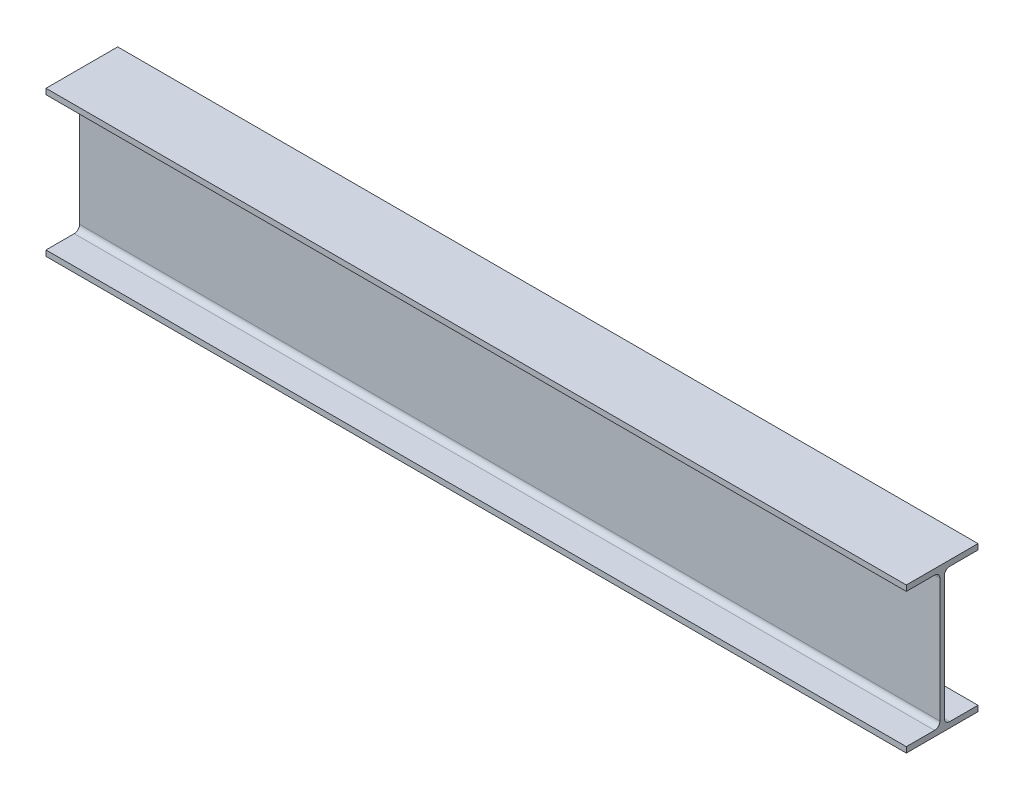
ISO-10303-21;
HEADER;
FILE_DESCRIPTION(('STEP AP214'),'2;1');
FILE_NAME('part.step','',(''),(''),'','','');
FILE_SCHEMA(('AUTOMOTIVE_DESIGN { 1 0 10303 214 1 1 1 1 }'));
ENDSEC;
DATA;
#1=APPLICATION_CONTEXT('core data for automotive mechanical design processes');
#2=APPLICATION_PROTOCOL_DEFINITION('international standard','automotive_design',2000,#1);
#3=PRODUCT_CONTEXT('',#1,'mechanical');
#4=PRODUCT('Part','Part','',(#3));
#5=PRODUCT_RELATED_PRODUCT_CATEGORY('part','',(#4));
#6=PRODUCT_DEFINITION_FORMATION('','',#4);
#7=PRODUCT_DEFINITION_CONTEXT('part definition',#1,'design');
#8=PRODUCT_DEFINITION('design','',#6,#7);
#9=PRODUCT_DEFINITION_SHAPE('','',#8);
#10=(LENGTH_UNIT() NAMED_UNIT(*) SI_UNIT(.MILLI.,.METRE.));
#11=(NAMED_UNIT(*) PLANE_ANGLE_UNIT() SI_UNIT($,.RADIAN.));
#12=(NAMED_UNIT(*) SI_UNIT($,.STERADIAN.) SOLID_ANGLE_UNIT());
#13=UNCERTAINTY_MEASURE_WITH_UNIT(LENGTH_MEASURE(1.E-05),#10,'distance_accuracy_value','');
#14=(GEOMETRIC_REPRESENTATION_CONTEXT(3) GLOBAL_UNCERTAINTY_ASSIGNED_CONTEXT((#13)) GLOBAL_UNIT_ASSIGNED_CONTEXT((#10,
#11,#12)) REPRESENTATION_CONTEXT('',''));
#15=CARTESIAN_POINT('',(0.,0.,0.));
#16=DIRECTION('',(0.,0.,1.));
#17=DIRECTION('',(1.,0.,0.));
#18=AXIS2_PLACEMENT_3D('',#15,#16,#17);
#19=CARTESIAN_POINT('',(609.6,95.25,50.8));
#20=DIRECTION('',(0.,0.,-1.));
#21=DIRECTION('',(-1.,0.,0.));
#22=AXIS2_PLACEMENT_3D('',#19,#20,#21);
#23=PLANE('',#22);
#24=DIRECTION('',(0.,-1.,0.));
#25=VECTOR('',#24,1.);
#26=CARTESIAN_POINT('',(-609.6,95.25,50.8));
#27=LINE('',#26,#25);
#28=CARTESIAN_POINT('',(-609.6,103.1875,50.8));
#29=VERTEX_POINT('',#28);
#30=CARTESIAN_POINT('',(-609.6,95.25,50.8));
#31=VERTEX_POINT('',#30);
#32=EDGE_CURVE('E177',#29,#31,#27,.T.);
#33=ORIENTED_EDGE('',*,*,#32,.T.);
#34=DIRECTION('',(-1.,0.,0.));
#35=VECTOR('',#34,1.);
#36=CARTESIAN_POINT('',(609.6,95.25,50.8));
#37=LINE('',#36,#35);
#38=CARTESIAN_POINT('',(609.6,95.25,50.8));
#39=VERTEX_POINT('',#38);
#40=EDGE_CURVE('E11',#39,#31,#37,.T.);
#41=ORIENTED_EDGE('',*,*,#40,.F.);
#42=DIRECTION('',(0.,-1.,0.));
#43=VECTOR('',#42,1.);
#44=CARTESIAN_POINT('',(609.6,95.25,50.8));
#45=LINE('',#44,#43);
#46=CARTESIAN_POINT('',(609.6,103.1875,50.8));
#47=VERTEX_POINT('',#46);
#48=EDGE_CURVE('E207',#47,#39,#45,.T.);
#49=ORIENTED_EDGE('',*,*,#48,.F.);
#50=DIRECTION('',(-1.,0.,0.));
#51=VECTOR('',#50,1.);
#52=CARTESIAN_POINT('',(609.6,103.1875,50.8));
#53=LINE('',#52,#51);
#54=EDGE_CURVE('E173',#47,#29,#53,.T.);
#55=ORIENTED_EDGE('',*,*,#54,.T.);
#56=EDGE_LOOP('',(#33,#41,#49,#55));
#57=FACE_BOUND('',#56,.T.);
#58=ADVANCED_FACE('F33',(#57),#23,.F.);
#59=CARTESIAN_POINT('',(609.6,95.25,10.7950000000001));
#60=DIRECTION('',(0.,1.,0.));
#61=DIRECTION('',(0.,0.,1.));
#62=AXIS2_PLACEMENT_3D('',#59,#60,#61);
#63=PLANE('',#62);
#64=DIRECTION('',(0.,0.,-1.));
#65=VECTOR('',#64,1.);
#66=CARTESIAN_POINT('',(-609.6,95.25,10.7950000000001));
#67=LINE('',#66,#65);
#68=CARTESIAN_POINT('',(-609.6,95.25,10.7950000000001));
#69=VERTEX_POINT('',#68);
#70=EDGE_CURVE('E180',#31,#69,#67,.T.);
#71=ORIENTED_EDGE('',*,*,#70,.T.);
#72=DIRECTION('',(-1.,0.,0.));
#73=VECTOR('',#72,1.);
#74=CARTESIAN_POINT('',(609.6,95.25,10.7950000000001));
#75=LINE('',#74,#73);
#76=CARTESIAN_POINT('',(609.6,95.25,10.7950000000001));
#77=VERTEX_POINT('',#76);
#78=EDGE_CURVE('E41',#77,#69,#75,.T.);
#79=ORIENTED_EDGE('',*,*,#78,.F.);
#80=DIRECTION('',(0.,0.,-1.));
#81=VECTOR('',#80,1.);
#82=CARTESIAN_POINT('',(609.6,95.25,10.7950000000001));
#83=LINE('',#82,#81);
#84=EDGE_CURVE('E116',#39,#77,#83,.T.);
#85=ORIENTED_EDGE('',*,*,#84,.F.);
#86=ORIENTED_EDGE('',*,*,#40,.T.);
#87=EDGE_LOOP('',(#71,#79,#85,#86));
#88=FACE_BOUND('',#87,.T.);
#89=ADVANCED_FACE('F305',(#88),#63,.F.);
#90=CARTESIAN_POINT('',(609.6,87.63,10.795));
#91=DIRECTION('',(-1.,0.,0.));
#92=DIRECTION('',(0.,0.,1.));
#93=AXIS2_PLACEMENT_3D('',#90,#91,#92);
#94=CYLINDRICAL_SURFACE('',#93,7.62);
#95=CARTESIAN_POINT('',(-609.6,87.63,10.795));
#96=DIRECTION('',(-1.,0.,0.));
#97=DIRECTION('',(0.,0.,-1.));
#98=AXIS2_PLACEMENT_3D('',#95,#96,#97);
#99=CIRCLE('',#98,7.62);
#100=CARTESIAN_POINT('',(-609.6,87.63,3.17500000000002));
#101=VERTEX_POINT('',#100);
#102=EDGE_CURVE('E182',#69,#101,#99,.T.);
#103=ORIENTED_EDGE('',*,*,#102,.T.);
#104=DIRECTION('',(-1.,0.,0.));
#105=VECTOR('',#104,1.);
#106=CARTESIAN_POINT('',(609.6,87.63,3.17500000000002));
#107=LINE('',#106,#105);
#108=CARTESIAN_POINT('',(609.6,87.63,3.17500000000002));
#109=VERTEX_POINT('',#108);
#110=EDGE_CURVE('E238',#109,#101,#107,.T.);
#111=ORIENTED_EDGE('',*,*,#110,.F.);
#112=CARTESIAN_POINT('',(609.6,87.63,10.795));
#113=DIRECTION('',(-1.,0.,0.));
#114=DIRECTION('',(0.,0.,-1.));
#115=AXIS2_PLACEMENT_3D('',#112,#113,#114);
#116=CIRCLE('',#115,7.62);
#117=EDGE_CURVE('E246',#77,#109,#116,.T.);
#118=ORIENTED_EDGE('',*,*,#117,.F.);
#119=ORIENTED_EDGE('',*,*,#78,.T.);
#120=EDGE_LOOP('',(#103,#111,#118,#119));
#121=FACE_BOUND('',#120,.T.);
#122=ADVANCED_FACE('F244',(#121),#94,.F.);
#123=CARTESIAN_POINT('',(609.6,-87.63,3.17499999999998));
#124=DIRECTION('',(0.,0.,-1.));
#125=DIRECTION('',(0.,1.,0.));
#126=AXIS2_PLACEMENT_3D('',#123,#124,#125);
#127=PLANE('',#126);
#128=DIRECTION('',(0.,-1.,0.));
#129=VECTOR('',#128,1.);
#130=CARTESIAN_POINT('',(-609.6,-87.63,3.17499999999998));
#131=LINE('',#130,#129);
#132=CARTESIAN_POINT('',(-609.6,-87.63,3.17499999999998));
#133=VERTEX_POINT('',#132);
#134=EDGE_CURVE('E184',#101,#133,#131,.T.);
#135=ORIENTED_EDGE('',*,*,#134,.T.);
#136=DIRECTION('',(-1.,0.,0.));
#137=VECTOR('',#136,1.);
#138=CARTESIAN_POINT('',(609.6,-87.63,3.17499999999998));
#139=LINE('',#138,#137);
#140=CARTESIAN_POINT('',(609.6,-87.63,3.17499999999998));
#141=VERTEX_POINT('',#140);
#142=EDGE_CURVE('E235',#141,#133,#139,.T.);
#143=ORIENTED_EDGE('',*,*,#142,.F.);
#144=DIRECTION('',(0.,-1.,0.));
#145=VECTOR('',#144,1.);
#146=CARTESIAN_POINT('',(609.6,-87.63,3.17499999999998));
#147=LINE('',#146,#145);
#148=EDGE_CURVE('E264',#109,#141,#147,.T.);
#149=ORIENTED_EDGE('',*,*,#148,.F.);
#150=ORIENTED_EDGE('',*,*,#110,.T.);
#151=EDGE_LOOP('',(#135,#143,#149,#150));
#152=FACE_BOUND('',#151,.T.);
#153=ADVANCED_FACE('F255',(#152),#127,.F.);
#154=CARTESIAN_POINT('',(609.6,-87.63,10.795));
#155=DIRECTION('',(-1.,0.,0.));
#156=DIRECTION('',(0.,0.,1.));
#157=AXIS2_PLACEMENT_3D('',#154,#155,#156);
#158=CYLINDRICAL_SURFACE('',#157,7.62);
#159=CARTESIAN_POINT('',(-609.6,-87.63,10.795));
#160=DIRECTION('',(-1.,0.,0.));
#161=DIRECTION('',(0.,0.,-1.));
#162=AXIS2_PLACEMENT_3D('',#159,#160,#161);
#163=CIRCLE('',#162,7.62);
#164=CARTESIAN_POINT('',(-609.6,-95.25,10.795));
#165=VERTEX_POINT('',#164);
#166=EDGE_CURVE('E186',#133,#165,#163,.T.);
#167=ORIENTED_EDGE('',*,*,#166,.T.);
#168=DIRECTION('',(-1.,0.,0.));
#169=VECTOR('',#168,1.);
#170=CARTESIAN_POINT('',(609.6,-95.25,10.795));
#171=LINE('',#170,#169);
#172=CARTESIAN_POINT('',(609.6,-95.25,10.795));
#173=VERTEX_POINT('',#172);
#174=EDGE_CURVE('E232',#173,#165,#171,.T.);
#175=ORIENTED_EDGE('',*,*,#174,.F.);
#176=CARTESIAN_POINT('',(609.6,-87.63,10.795));
#177=DIRECTION('',(-1.,0.,0.));
#178=DIRECTION('',(0.,0.,-1.));
#179=AXIS2_PLACEMENT_3D('',#176,#177,#178);
#180=CIRCLE('',#179,7.62);
#181=EDGE_CURVE('E261',#141,#173,#180,.T.);
#182=ORIENTED_EDGE('',*,*,#181,.F.);
#183=ORIENTED_EDGE('',*,*,#142,.T.);
#184=EDGE_LOOP('',(#167,#175,#182,#183));
#185=FACE_BOUND('',#184,.T.);
#186=ADVANCED_FACE('F259',(#185),#158,.F.);
#187=CARTESIAN_POINT('',(609.6,-95.25,50.8));
#188=DIRECTION('',(0.,-1.,0.));
#189=DIRECTION('',(0.,0.,-1.));
#190=AXIS2_PLACEMENT_3D('',#187,#188,#189);
#191=PLANE('',#190);
#192=DIRECTION('',(0.,0.,1.));
#193=VECTOR('',#192,1.);
#194=CARTESIAN_POINT('',(-609.6,-95.25,50.8));
#195=LINE('',#194,#193);
#196=CARTESIAN_POINT('',(-609.6,-95.25,50.8));
#197=VERTEX_POINT('',#196);
#198=EDGE_CURVE('E188',#165,#197,#195,.T.);
#199=ORIENTED_EDGE('',*,*,#198,.T.);
#200=DIRECTION('',(-1.,0.,0.));
#201=VECTOR('',#200,1.);
#202=CARTESIAN_POINT('',(609.6,-95.25,50.8));
#203=LINE('',#202,#201);
#204=CARTESIAN_POINT('',(609.6,-95.25,50.8));
#205=VERTEX_POINT('',#204);
#206=EDGE_CURVE('E229',#205,#197,#203,.T.);
#207=ORIENTED_EDGE('',*,*,#206,.F.);
#208=DIRECTION('',(0.,0.,1.));
#209=VECTOR('',#208,1.);
#210=CARTESIAN_POINT('',(609.6,-95.25,50.8));
#211=LINE('',#210,#209);
#212=EDGE_CURVE('E263',#173,#205,#211,.T.);
#213=ORIENTED_EDGE('',*,*,#212,.F.);
#214=ORIENTED_EDGE('',*,*,#174,.T.);
#215=EDGE_LOOP('',(#199,#207,#213,#214));
#216=FACE_BOUND('',#215,.T.);
#217=ADVANCED_FACE('F318',(#216),#191,.F.);
#218=CARTESIAN_POINT('',(609.6,-103.1875,50.8));
#219=DIRECTION('',(0.,0.,-1.));
#220=DIRECTION('',(-1.,0.,0.));
#221=AXIS2_PLACEMENT_3D('',#218,#219,#220);
#222=PLANE('',#221);
#223=DIRECTION('',(0.,-1.,0.));
#224=VECTOR('',#223,1.);
#225=CARTESIAN_POINT('',(-609.6,-103.1875,50.8));
#226=LINE('',#225,#224);
#227=CARTESIAN_POINT('',(-609.6,-103.1875,50.8));
#228=VERTEX_POINT('',#227);
#229=EDGE_CURVE('E190',#197,#228,#226,.T.);
#230=ORIENTED_EDGE('',*,*,#229,.T.);
#231=DIRECTION('',(-1.,0.,0.));
#232=VECTOR('',#231,1.);
#233=CARTESIAN_POINT('',(609.6,-103.1875,50.8));
#234=LINE('',#233,#232);
#235=CARTESIAN_POINT('',(609.6,-103.1875,50.8));
#236=VERTEX_POINT('',#235);
#237=EDGE_CURVE('E226',#236,#228,#234,.T.);
#238=ORIENTED_EDGE('',*,*,#237,.F.);
#239=DIRECTION('',(0.,-1.,0.));
#240=VECTOR('',#239,1.);
#241=CARTESIAN_POINT('',(609.6,-103.1875,50.8));
#242=LINE('',#241,#240);
#243=EDGE_CURVE('E266',#205,#236,#242,.T.);
#244=ORIENTED_EDGE('',*,*,#243,.F.);
#245=ORIENTED_EDGE('',*,*,#206,.T.);
#246=EDGE_LOOP('',(#230,#238,#244,#245));
#247=FACE_BOUND('',#246,.T.);
#248=ADVANCED_FACE('F321',(#247),#222,.F.);
#249=CARTESIAN_POINT('',(609.6,-103.1875,-50.8));
#250=DIRECTION('',(0.,1.,0.));
#251=DIRECTION('',(0.,0.,1.));
#252=AXIS2_PLACEMENT_3D('',#249,#250,#251);
#253=PLANE('',#252);
#254=DIRECTION('',(0.,0.,-1.));
#255=VECTOR('',#254,1.);
#256=CARTESIAN_POINT('',(-609.6,-103.1875,-50.8));
#257=LINE('',#256,#255);
#258=CARTESIAN_POINT('',(-609.6,-103.1875,-50.8));
#259=VERTEX_POINT('',#258);
#260=EDGE_CURVE('E192',#228,#259,#257,.T.);
#261=ORIENTED_EDGE('',*,*,#260,.T.);
#262=DIRECTION('',(-1.,0.,0.));
#263=VECTOR('',#262,1.);
#264=CARTESIAN_POINT('',(609.6,-103.1875,-50.8));
#265=LINE('',#264,#263);
#266=CARTESIAN_POINT('',(609.6,-103.1875,-50.8));
#267=VERTEX_POINT('',#266);
#268=EDGE_CURVE('E223',#267,#259,#265,.T.);
#269=ORIENTED_EDGE('',*,*,#268,.F.);
#270=DIRECTION('',(0.,0.,-1.));
#271=VECTOR('',#270,1.);
#272=CARTESIAN_POINT('',(609.6,-103.1875,-50.8));
#273=LINE('',#272,#271);
#274=EDGE_CURVE('E272',#236,#267,#273,.T.);
#275=ORIENTED_EDGE('',*,*,#274,.F.);
#276=ORIENTED_EDGE('',*,*,#237,.T.);
#277=EDGE_LOOP('',(#261,#269,#275,#276));
#278=FACE_BOUND('',#277,.T.);
#279=ADVANCED_FACE('F325',(#278),#253,.F.);
#280=CARTESIAN_POINT('',(609.6,-95.25,-50.8000000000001));
#281=DIRECTION('',(0.,0.,1.));
#282=DIRECTION('',(0.,-1.,0.));
#283=AXIS2_PLACEMENT_3D('',#280,#281,#282);
#284=PLANE('',#283);
#285=DIRECTION('',(0.,1.,0.));
#286=VECTOR('',#285,1.);
#287=CARTESIAN_POINT('',(-609.6,-95.25,-50.8000000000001));
#288=LINE('',#287,#286);
#289=CARTESIAN_POINT('',(-609.6,-95.25,-50.8000000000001));
#290=VERTEX_POINT('',#289);
#291=EDGE_CURVE('E194',#259,#290,#288,.T.);
#292=ORIENTED_EDGE('',*,*,#291,.T.);
#293=DIRECTION('',(-1.,0.,0.));
#294=VECTOR('',#293,1.);
#295=CARTESIAN_POINT('',(609.6,-95.25,-50.8000000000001));
#296=LINE('',#295,#294);
#297=CARTESIAN_POINT('',(609.6,-95.25,-50.8000000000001));
#298=VERTEX_POINT('',#297);
#299=EDGE_CURVE('E220',#298,#290,#296,.T.);
#300=ORIENTED_EDGE('',*,*,#299,.F.);
#301=DIRECTION('',(0.,1.,0.));
#302=VECTOR('',#301,1.);
#303=CARTESIAN_POINT('',(609.6,-95.25,-50.8000000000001));
#304=LINE('',#303,#302);
#305=EDGE_CURVE('E274',#267,#298,#304,.T.);
#306=ORIENTED_EDGE('',*,*,#305,.F.);
#307=ORIENTED_EDGE('',*,*,#268,.T.);
#308=EDGE_LOOP('',(#292,#300,#306,#307));
#309=FACE_BOUND('',#308,.T.);
#310=ADVANCED_FACE('F329',(#309),#284,.F.);
#311=CARTESIAN_POINT('',(609.6,-95.25,-10.7950000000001));
#312=DIRECTION('',(0.,-1.,0.));
#313=DIRECTION('',(0.,0.,-1.));
#314=AXIS2_PLACEMENT_3D('',#311,#312,#313);
#315=PLANE('',#314);
#316=DIRECTION('',(0.,0.,1.));
#317=VECTOR('',#316,1.);
#318=CARTESIAN_POINT('',(-609.6,-95.25,-10.7950000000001));
#319=LINE('',#318,#317);
#320=CARTESIAN_POINT('',(-609.6,-95.25,-10.7950000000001));
#321=VERTEX_POINT('',#320);
#322=EDGE_CURVE('E196',#290,#321,#319,.T.);
#323=ORIENTED_EDGE('',*,*,#322,.T.);
#324=DIRECTION('',(-1.,0.,0.));
#325=VECTOR('',#324,1.);
#326=CARTESIAN_POINT('',(609.6,-95.25,-10.7950000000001));
#327=LINE('',#326,#325);
#328=CARTESIAN_POINT('',(609.6,-95.25,-10.7950000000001));
#329=VERTEX_POINT('',#328);
#330=EDGE_CURVE('E217',#329,#321,#327,.T.);
#331=ORIENTED_EDGE('',*,*,#330,.F.);
#332=DIRECTION('',(0.,0.,1.));
#333=VECTOR('',#332,1.);
#334=CARTESIAN_POINT('',(609.6,-95.25,-10.7950000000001));
#335=LINE('',#334,#333);
#336=EDGE_CURVE('E276',#298,#329,#335,.T.);
#337=ORIENTED_EDGE('',*,*,#336,.F.);
#338=ORIENTED_EDGE('',*,*,#299,.T.);
#339=EDGE_LOOP('',(#323,#331,#337,#338));
#340=FACE_BOUND('',#339,.T.);
#341=ADVANCED_FACE('F333',(#340),#315,.F.);
#342=CARTESIAN_POINT('',(609.6,-87.63,-10.795));
#343=DIRECTION('',(-1.,0.,0.));
#344=DIRECTION('',(0.,0.,1.));
#345=AXIS2_PLACEMENT_3D('',#342,#343,#344);
#346=CYLINDRICAL_SURFACE('',#345,7.62);
#347=CARTESIAN_POINT('',(-609.6,-87.63,-10.795));
#348=DIRECTION('',(-1.,0.,0.));
#349=DIRECTION('',(0.,0.,1.));
#350=AXIS2_PLACEMENT_3D('',#347,#348,#349);
#351=CIRCLE('',#350,7.62);
#352=CARTESIAN_POINT('',(-609.6,-87.63,-3.17500000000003));
#353=VERTEX_POINT('',#352);
#354=EDGE_CURVE('E198',#321,#353,#351,.T.);
#355=ORIENTED_EDGE('',*,*,#354,.T.);
#356=DIRECTION('',(-1.,0.,0.));
#357=VECTOR('',#356,1.);
#358=CARTESIAN_POINT('',(609.6,-87.63,-3.17500000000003));
#359=LINE('',#358,#357);
#360=CARTESIAN_POINT('',(609.6,-87.63,-3.17500000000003));
#361=VERTEX_POINT('',#360);
#362=EDGE_CURVE('E214',#361,#353,#359,.T.);
#363=ORIENTED_EDGE('',*,*,#362,.F.);
#364=CARTESIAN_POINT('',(609.6,-87.63,-10.795));
#365=DIRECTION('',(-1.,0.,0.));
#366=DIRECTION('',(0.,0.,1.));
#367=AXIS2_PLACEMENT_3D('',#364,#365,#366);
#368=CIRCLE('',#367,7.62);
#369=EDGE_CURVE('E278',#329,#361,#368,.T.);
#370=ORIENTED_EDGE('',*,*,#369,.F.);
#371=ORIENTED_EDGE('',*,*,#330,.T.);
#372=EDGE_LOOP('',(#355,#363,#370,#371));
#373=FACE_BOUND('',#372,.T.);
#374=ADVANCED_FACE('F337',(#373),#346,.F.);
#375=CARTESIAN_POINT('',(609.6,87.63,-3.17500000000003));
#376=DIRECTION('',(0.,0.,1.));
#377=DIRECTION('',(1.,0.,0.));
#378=AXIS2_PLACEMENT_3D('',#375,#376,#377);
#379=PLANE('',#378);
#380=DIRECTION('',(0.,1.,0.));
#381=VECTOR('',#380,1.);
#382=CARTESIAN_POINT('',(-609.6,87.63,-3.17500000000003));
#383=LINE('',#382,#381);
#384=CARTESIAN_POINT('',(-609.6,87.63,-3.17500000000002));
#385=VERTEX_POINT('',#384);
#386=EDGE_CURVE('E200',#353,#385,#383,.T.);
#387=ORIENTED_EDGE('',*,*,#386,.T.);
#388=DIRECTION('',(-1.,0.,0.));
#389=VECTOR('',#388,1.);
#390=CARTESIAN_POINT('',(609.6,87.63,-3.17500000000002));
#391=LINE('',#390,#389);
#392=CARTESIAN_POINT('',(609.6,87.63,-3.17500000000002));
#393=VERTEX_POINT('',#392);
#394=EDGE_CURVE('E211',#393,#385,#391,.T.);
#395=ORIENTED_EDGE('',*,*,#394,.F.);
#396=DIRECTION('',(0.,1.,0.));
#397=VECTOR('',#396,1.);
#398=CARTESIAN_POINT('',(609.6,87.63,-3.17500000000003));
#399=LINE('',#398,#397);
#400=EDGE_CURVE('E280',#361,#393,#399,.T.);
#401=ORIENTED_EDGE('',*,*,#400,.F.);
#402=ORIENTED_EDGE('',*,*,#362,.T.);
#403=EDGE_LOOP('',(#387,#395,#401,#402));
#404=FACE_BOUND('',#403,.T.);
#405=ADVANCED_FACE('F286',(#404),#379,.F.);
#406=CARTESIAN_POINT('',(609.6,87.63,-10.795));
#407=DIRECTION('',(-1.,0.,0.));
#408=DIRECTION('',(0.,0.,1.));
#409=AXIS2_PLACEMENT_3D('',#406,#407,#408);
#410=CYLINDRICAL_SURFACE('',#409,7.62);
#411=CARTESIAN_POINT('',(-609.6,87.63,-10.795));
#412=DIRECTION('',(-1.,0.,0.));
#413=DIRECTION('',(0.,0.,1.));
#414=AXIS2_PLACEMENT_3D('',#411,#412,#413);
#415=CIRCLE('',#414,7.62);
#416=CARTESIAN_POINT('',(-609.6,95.25,-10.7950000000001));
#417=VERTEX_POINT('',#416);
#418=EDGE_CURVE('E202',#385,#417,#415,.T.);
#419=ORIENTED_EDGE('',*,*,#418,.T.);
#420=DIRECTION('',(-1.,0.,0.));
#421=VECTOR('',#420,1.);
#422=CARTESIAN_POINT('',(609.6,95.25,-10.7950000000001));
#423=LINE('',#422,#421);
#424=CARTESIAN_POINT('',(609.6,95.25,-10.7950000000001));
#425=VERTEX_POINT('',#424);
#426=EDGE_CURVE('E168',#425,#417,#423,.T.);
#427=ORIENTED_EDGE('',*,*,#426,.F.);
#428=CARTESIAN_POINT('',(609.6,87.63,-10.795));
#429=DIRECTION('',(-1.,0.,0.));
#430=DIRECTION('',(0.,0.,1.));
#431=AXIS2_PLACEMENT_3D('',#428,#429,#430);
#432=CIRCLE('',#431,7.62);
#433=EDGE_CURVE('E159',#393,#425,#432,.T.);
#434=ORIENTED_EDGE('',*,*,#433,.F.);
#435=ORIENTED_EDGE('',*,*,#394,.T.);
#436=EDGE_LOOP('',(#419,#427,#434,#435));
#437=FACE_BOUND('',#436,.T.);
#438=ADVANCED_FACE('F290',(#437),#410,.F.);
#439=CARTESIAN_POINT('',(609.6,95.25,-50.8));
#440=DIRECTION('',(0.,1.,0.));
#441=DIRECTION('',(0.,0.,1.));
#442=AXIS2_PLACEMENT_3D('',#439,#440,#441);
#443=PLANE('',#442);
#444=DIRECTION('',(0.,0.,-1.));
#445=VECTOR('',#444,1.);
#446=CARTESIAN_POINT('',(-609.6,95.25,-50.8));
#447=LINE('',#446,#445);
#448=CARTESIAN_POINT('',(-609.6,95.25,-50.8));
#449=VERTEX_POINT('',#448);
#450=EDGE_CURVE('E167',#417,#449,#447,.T.);
#451=ORIENTED_EDGE('',*,*,#450,.T.);
#452=DIRECTION('',(-1.,0.,0.));
#453=VECTOR('',#452,1.);
#454=CARTESIAN_POINT('',(609.6,95.25,-50.8));
#455=LINE('',#454,#453);
#456=CARTESIAN_POINT('',(609.6,95.25,-50.8));
#457=VERTEX_POINT('',#456);
#458=EDGE_CURVE('E164',#457,#449,#455,.T.);
#459=ORIENTED_EDGE('',*,*,#458,.F.);
#460=DIRECTION('',(0.,0.,-1.));
#461=VECTOR('',#460,1.);
#462=CARTESIAN_POINT('',(609.6,95.25,-50.8));
#463=LINE('',#462,#461);
#464=EDGE_CURVE('E153',#425,#457,#463,.T.);
#465=ORIENTED_EDGE('',*,*,#464,.F.);
#466=ORIENTED_EDGE('',*,*,#426,.T.);
#467=EDGE_LOOP('',(#451,#459,#465,#466));
#468=FACE_BOUND('',#467,.T.);
#469=ADVANCED_FACE('F165',(#468),#443,.F.);
#470=CARTESIAN_POINT('',(609.6,103.1875,-50.8));
#471=DIRECTION('',(0.,0.,1.));
#472=DIRECTION('',(1.,0.,0.));
#473=AXIS2_PLACEMENT_3D('',#470,#471,#472);
#474=PLANE('',#473);
#475=DIRECTION('',(0.,1.,0.));
#476=VECTOR('',#475,1.);
#477=CARTESIAN_POINT('',(-609.6,103.1875,-50.8));
#478=LINE('',#477,#476);
#479=CARTESIAN_POINT('',(-609.6,103.1875,-50.8));
#480=VERTEX_POINT('',#479);
#481=EDGE_CURVE('E102',#449,#480,#478,.T.);
#482=ORIENTED_EDGE('',*,*,#481,.T.);
#483=DIRECTION('',(-1.,0.,0.));
#484=VECTOR('',#483,1.);
#485=CARTESIAN_POINT('',(609.6,103.1875,-50.8));
#486=LINE('',#485,#484);
#487=CARTESIAN_POINT('',(609.6,103.1875,-50.8));
#488=VERTEX_POINT('',#487);
#489=EDGE_CURVE('E169',#488,#480,#486,.T.);
#490=ORIENTED_EDGE('',*,*,#489,.F.);
#491=DIRECTION('',(0.,1.,0.));
#492=VECTOR('',#491,1.);
#493=CARTESIAN_POINT('',(609.6,103.1875,-50.8));
#494=LINE('',#493,#492);
#495=EDGE_CURVE('E157',#457,#488,#494,.T.);
#496=ORIENTED_EDGE('',*,*,#495,.F.);
#497=ORIENTED_EDGE('',*,*,#458,.T.);
#498=EDGE_LOOP('',(#482,#490,#496,#497));
#499=FACE_BOUND('',#498,.T.);
#500=ADVANCED_FACE('F171',(#499),#474,.F.);
#501=CARTESIAN_POINT('',(609.6,103.1875,50.8));
#502=DIRECTION('',(0.,-1.,0.));
#503=DIRECTION('',(0.,0.,-1.));
#504=AXIS2_PLACEMENT_3D('',#501,#502,#503);
#505=PLANE('',#504);
#506=DIRECTION('',(0.,0.,1.));
#507=VECTOR('',#506,1.);
#508=CARTESIAN_POINT('',(-609.6,103.1875,50.8));
#509=LINE('',#508,#507);
#510=EDGE_CURVE('E108',#480,#29,#509,.T.);
#511=ORIENTED_EDGE('',*,*,#510,.T.);
#512=ORIENTED_EDGE('',*,*,#54,.F.);
#513=DIRECTION('',(0.,0.,1.));
#514=VECTOR('',#513,1.);
#515=CARTESIAN_POINT('',(609.6,103.1875,50.8));
#516=LINE('',#515,#514);
#517=EDGE_CURVE('E49',#488,#47,#516,.T.);
#518=ORIENTED_EDGE('',*,*,#517,.F.);
#519=ORIENTED_EDGE('',*,*,#489,.T.);
#520=EDGE_LOOP('',(#511,#512,#518,#519));
#521=FACE_BOUND('',#520,.T.);
#522=ADVANCED_FACE('F294',(#521),#505,.F.);
#523=CARTESIAN_POINT('',(609.6,87.63,-10.795));
#524=DIRECTION('',(-1.,0.,0.));
#525=DIRECTION('',(0.,0.,1.));
#526=AXIS2_PLACEMENT_3D('',#523,#524,#525);
#527=PLANE('',#526);
#528=ORIENTED_EDGE('',*,*,#48,.T.);
#529=ORIENTED_EDGE('',*,*,#84,.T.);
#530=ORIENTED_EDGE('',*,*,#117,.T.);
#531=ORIENTED_EDGE('',*,*,#148,.T.);
#532=ORIENTED_EDGE('',*,*,#181,.T.);
#533=ORIENTED_EDGE('',*,*,#212,.T.);
#534=ORIENTED_EDGE('',*,*,#243,.T.);
#535=ORIENTED_EDGE('',*,*,#274,.T.);
#536=ORIENTED_EDGE('',*,*,#305,.T.);
#537=ORIENTED_EDGE('',*,*,#336,.T.);
#538=ORIENTED_EDGE('',*,*,#369,.T.);
#539=ORIENTED_EDGE('',*,*,#400,.T.);
#540=ORIENTED_EDGE('',*,*,#433,.T.);
#541=ORIENTED_EDGE('',*,*,#464,.T.);
#542=ORIENTED_EDGE('',*,*,#495,.T.);
#543=ORIENTED_EDGE('',*,*,#517,.T.);
#544=EDGE_LOOP('',(#528,#529,#530,#531,#532,#533,#534,#535,#536,#537,#538,#539,#540,#541,#542,#543));
#545=FACE_BOUND('',#544,.T.);
#546=ADVANCED_FACE('F155',(#545),#527,.F.);
#547=CARTESIAN_POINT('',(-609.6,87.63,-10.795));
#548=DIRECTION('',(-1.,0.,0.));
#549=DIRECTION('',(0.,0.,1.));
#550=AXIS2_PLACEMENT_3D('',#547,#548,#549);
#551=PLANE('',#550);
#552=ORIENTED_EDGE('',*,*,#32,.F.);
#553=ORIENTED_EDGE('',*,*,#510,.F.);
#554=ORIENTED_EDGE('',*,*,#481,.F.);
#555=ORIENTED_EDGE('',*,*,#450,.F.);
#556=ORIENTED_EDGE('',*,*,#418,.F.);
#557=ORIENTED_EDGE('',*,*,#386,.F.);
#558=ORIENTED_EDGE('',*,*,#354,.F.);
#559=ORIENTED_EDGE('',*,*,#322,.F.);
#560=ORIENTED_EDGE('',*,*,#291,.F.);
#561=ORIENTED_EDGE('',*,*,#260,.F.);
#562=ORIENTED_EDGE('',*,*,#229,.F.);
#563=ORIENTED_EDGE('',*,*,#198,.F.);
#564=ORIENTED_EDGE('',*,*,#166,.F.);
#565=ORIENTED_EDGE('',*,*,#134,.F.);
#566=ORIENTED_EDGE('',*,*,#102,.F.);
#567=ORIENTED_EDGE('',*,*,#70,.F.);
#568=EDGE_LOOP('',(#552,#553,#554,#555,#556,#557,#558,#559,#560,#561,#562,#563,#564,#565,#566,#567));
#569=FACE_BOUND('',#568,.T.);
#570=ADVANCED_FACE('F250',(#569),#551,.T.);
#571=CLOSED_SHELL('',(#58,#89,#122,#153,#186,#217,#248,#279,#310,#341,#374,#405,#438,#469,#500,
#522,#546,#570));
#572=MANIFOLD_SOLID_BREP('B2',#571);
#573=ADVANCED_BREP_SHAPE_REPRESENTATION('',(#18,#572),#14);
#574=SHAPE_DEFINITION_REPRESENTATION(#9,#573);
ENDSEC;
END-ISO-10303-21;
